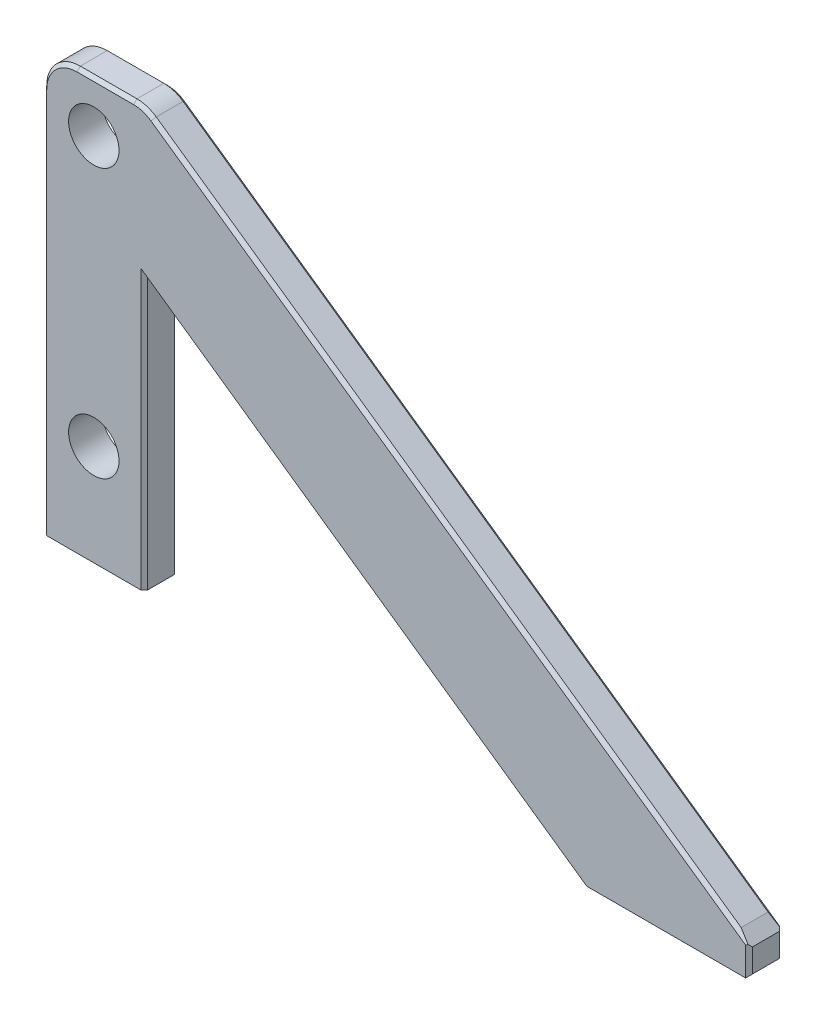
ISO-10303-21;
HEADER;
FILE_DESCRIPTION(('STEP AP214'),'2;1');
FILE_NAME('part.step','',(''),(''),'','','');
FILE_SCHEMA(('AUTOMOTIVE_DESIGN { 1 0 10303 214 1 1 1 1 }'));
ENDSEC;
DATA;
#1=APPLICATION_CONTEXT('core data for automotive mechanical design processes');
#2=APPLICATION_PROTOCOL_DEFINITION('international standard','automotive_design',2000,#1);
#3=PRODUCT_CONTEXT('',#1,'mechanical');
#4=PRODUCT('Part','Part','',(#3));
#5=PRODUCT_RELATED_PRODUCT_CATEGORY('part','',(#4));
#6=PRODUCT_DEFINITION_FORMATION('','',#4);
#7=PRODUCT_DEFINITION_CONTEXT('part definition',#1,'design');
#8=PRODUCT_DEFINITION('design','',#6,#7);
#9=PRODUCT_DEFINITION_SHAPE('','',#8);
#10=(LENGTH_UNIT() NAMED_UNIT(*) SI_UNIT(.MILLI.,.METRE.));
#11=(NAMED_UNIT(*) PLANE_ANGLE_UNIT() SI_UNIT($,.RADIAN.));
#12=(NAMED_UNIT(*) SI_UNIT($,.STERADIAN.) SOLID_ANGLE_UNIT());
#13=UNCERTAINTY_MEASURE_WITH_UNIT(LENGTH_MEASURE(1.E-05),#10,'distance_accuracy_value','');
#14=(GEOMETRIC_REPRESENTATION_CONTEXT(3) GLOBAL_UNCERTAINTY_ASSIGNED_CONTEXT((#13)) GLOBAL_UNIT_ASSIGNED_CONTEXT((#10,
#11,#12)) REPRESENTATION_CONTEXT('',''));
#15=CARTESIAN_POINT('',(0.,0.,0.));
#16=DIRECTION('',(0.,0.,1.));
#17=DIRECTION('',(1.,0.,0.));
#18=AXIS2_PLACEMENT_3D('',#15,#16,#17);
#19=CARTESIAN_POINT('',(-129.946648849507,90.9896230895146,10.));
#20=DIRECTION('',(0.,0.,-1.));
#21=DIRECTION('',(-1.,0.,0.));
#22=AXIS2_PLACEMENT_3D('',#19,#20,#21);
#23=PLANE('',#22);
#24=CARTESIAN_POINT('',(-144.946648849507,120.,10.));
#25=DIRECTION('',(0.,0.,1.));
#26=DIRECTION('',(1.,0.,0.));
#27=AXIS2_PLACEMENT_3D('',#24,#25,#26);
#28=CIRCLE('',#27,7.50000000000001);
#29=CARTESIAN_POINT('',(-137.446648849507,120.,10.));
#30=VERTEX_POINT('',#29);
#31=EDGE_CURVE('E222',#30,#30,#28,.T.);
#32=ORIENTED_EDGE('',*,*,#31,.F.);
#33=EDGE_LOOP('',(#32));
#34=FACE_BOUND('',#33,.T.);
#35=DIRECTION('',(1.,0.,0.));
#36=VECTOR('',#35,1.);
#37=CARTESIAN_POINT('',(50.,0.,10.));
#38=LINE('',#37,#36);
#39=CARTESIAN_POINT('',(1.74344679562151,0.,10.0000000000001));
#40=VERTEX_POINT('',#39);
#41=CARTESIAN_POINT('',(49.,0.,10.));
#42=VERTEX_POINT('',#41);
#43=EDGE_CURVE('E210',#40,#42,#38,.T.);
#44=ORIENTED_EDGE('',*,*,#43,.T.);
#45=DIRECTION('',(0.,1.,0.));
#46=VECTOR('',#45,1.);
#47=CARTESIAN_POINT('',(49.,90.9896230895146,10.));
#48=LINE('',#47,#46);
#49=CARTESIAN_POINT('',(49.,8.47943294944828,10.));
#50=VERTEX_POINT('',#49);
#51=EDGE_CURVE('E354',#42,#50,#48,.T.);
#52=ORIENTED_EDGE('',*,*,#51,.T.);
#53=DIRECTION('',(-0.819152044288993,0.573576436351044,0.));
#54=VECTOR('',#53,1.);
#55=CARTESIAN_POINT('',(-109.842112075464,119.701877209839,10.));
#56=LINE('',#55,#54);
#57=CARTESIAN_POINT('',(-127.937448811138,132.372368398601,10.));
#58=VERTEX_POINT('',#57);
#59=EDGE_CURVE('E245',#50,#58,#56,.T.);
#60=ORIENTED_EDGE('',*,*,#59,.T.);
#61=CARTESIAN_POINT('',(-133.099636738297,125.,10.));
#62=DIRECTION('',(0.,0.,-1.));
#63=DIRECTION('',(-1.,0.,0.));
#64=AXIS2_PLACEMENT_3D('',#61,#62,#63);
#65=CIRCLE('',#64,8.99999999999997);
#66=CARTESIAN_POINT('',(-133.099636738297,134.,10.));
#67=VERTEX_POINT('',#66);
#68=EDGE_CURVE('E247',#58,#67,#65,.F.);
#69=ORIENTED_EDGE('',*,*,#68,.T.);
#70=DIRECTION('',(-1.,0.,0.));
#71=VECTOR('',#70,1.);
#72=CARTESIAN_POINT('',(-129.946648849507,134.,10.));
#73=LINE('',#72,#71);
#74=CARTESIAN_POINT('',(-149.946648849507,134.,10.));
#75=VERTEX_POINT('',#74);
#76=EDGE_CURVE('E249',#67,#75,#73,.T.);
#77=ORIENTED_EDGE('',*,*,#76,.T.);
#78=CARTESIAN_POINT('',(-149.946648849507,125.,10.));
#79=DIRECTION('',(0.,0.,-1.));
#80=DIRECTION('',(-1.,0.,0.));
#81=AXIS2_PLACEMENT_3D('',#78,#79,#80);
#82=CIRCLE('',#81,8.99999999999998);
#83=CARTESIAN_POINT('',(-158.946648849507,125.,10.));
#84=VERTEX_POINT('',#83);
#85=EDGE_CURVE('E202',#75,#84,#82,.F.);
#86=ORIENTED_EDGE('',*,*,#85,.T.);
#87=DIRECTION('',(0.,-1.,0.));
#88=VECTOR('',#87,1.);
#89=CARTESIAN_POINT('',(-158.946648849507,90.9896230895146,10.));
#90=LINE('',#89,#88);
#91=CARTESIAN_POINT('',(-158.946648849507,9.99999999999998,10.));
#92=VERTEX_POINT('',#91);
#93=EDGE_CURVE('E186',#84,#92,#90,.T.);
#94=ORIENTED_EDGE('',*,*,#93,.T.);
#95=DIRECTION('',(1.,0.,0.));
#96=VECTOR('',#95,1.);
#97=CARTESIAN_POINT('',(-129.946648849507,9.99999999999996,10.));
#98=LINE('',#97,#96);
#99=CARTESIAN_POINT('',(-130.946648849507,9.99999999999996,10.));
#100=VERTEX_POINT('',#99);
#101=EDGE_CURVE('E199',#92,#100,#98,.T.);
#102=ORIENTED_EDGE('',*,*,#101,.T.);
#103=DIRECTION('',(0.,1.,0.));
#104=VECTOR('',#103,1.);
#105=CARTESIAN_POINT('',(-130.946648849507,90.9896230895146,10.));
#106=LINE('',#105,#104);
#107=CARTESIAN_POINT('',(-130.946648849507,92.9106052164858,10.));
#108=VERTEX_POINT('',#107);
#109=EDGE_CURVE('E243',#100,#108,#106,.T.);
#110=ORIENTED_EDGE('',*,*,#109,.T.);
#111=DIRECTION('',(0.819152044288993,-0.573576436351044,0.));
#112=VECTOR('',#111,1.);
#113=CARTESIAN_POINT('',(-129.373072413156,91.8087751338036,10.));
#114=LINE('',#113,#112);
#115=EDGE_CURVE('E241',#108,#40,#114,.T.);
#116=ORIENTED_EDGE('',*,*,#115,.T.);
#117=EDGE_LOOP('',(#44,#52,#60,#69,#77,#86,#94,#102,#110,#116));
#118=FACE_BOUND('',#117,.T.);
#119=CARTESIAN_POINT('',(-144.946648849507,39.9999999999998,10.));
#120=DIRECTION('',(0.,0.,1.));
#121=DIRECTION('',(1.,0.,0.));
#122=AXIS2_PLACEMENT_3D('',#119,#120,#121);
#123=CIRCLE('',#122,7.50000000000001);
#124=CARTESIAN_POINT('',(-137.446648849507,39.9999999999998,10.));
#125=VERTEX_POINT('',#124);
#126=EDGE_CURVE('E770',#125,#125,#123,.T.);
#127=ORIENTED_EDGE('',*,*,#126,.F.);
#128=EDGE_LOOP('',(#127));
#129=FACE_BOUND('',#128,.T.);
#130=ADVANCED_FACE('F32',(#34,#118,#129),#23,.F.);
#131=CARTESIAN_POINT('',(-129.946648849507,90.9896230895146,0.));
#132=DIRECTION('',(0.,0.,-1.));
#133=DIRECTION('',(-1.,0.,0.));
#134=AXIS2_PLACEMENT_3D('',#131,#132,#133);
#135=PLANE('',#134);
#136=CARTESIAN_POINT('',(-144.946648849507,120.,0.));
#137=DIRECTION('',(0.,0.,1.));
#138=DIRECTION('',(1.,0.,0.));
#139=AXIS2_PLACEMENT_3D('',#136,#137,#138);
#140=CIRCLE('',#139,7.50000000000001);
#141=CARTESIAN_POINT('',(-137.446648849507,120.,0.));
#142=VERTEX_POINT('',#141);
#143=EDGE_CURVE('E769',#142,#142,#140,.T.);
#144=ORIENTED_EDGE('',*,*,#143,.T.);
#145=EDGE_LOOP('',(#144));
#146=FACE_BOUND('',#145,.T.);
#147=DIRECTION('',(0.819152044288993,-0.573576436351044,0.));
#148=VECTOR('',#147,1.);
#149=CARTESIAN_POINT('',(49.426423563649,8.18084795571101,0.));
#150=LINE('',#149,#148);
#151=CARTESIAN_POINT('',(-127.937448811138,132.372368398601,0.));
#152=VERTEX_POINT('',#151);
#153=CARTESIAN_POINT('',(49.,8.47943294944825,0.));
#154=VERTEX_POINT('',#153);
#155=EDGE_CURVE('E290',#152,#154,#150,.T.);
#156=ORIENTED_EDGE('',*,*,#155,.T.);
#157=DIRECTION('',(0.,-1.,0.));
#158=VECTOR('',#157,1.);
#159=CARTESIAN_POINT('',(49.,0.,0.));
#160=LINE('',#159,#158);
#161=CARTESIAN_POINT('',(49.,0.,0.));
#162=VERTEX_POINT('',#161);
#163=EDGE_CURVE('E349',#154,#162,#160,.T.);
#164=ORIENTED_EDGE('',*,*,#163,.T.);
#165=DIRECTION('',(1.,0.,0.));
#166=VECTOR('',#165,1.);
#167=CARTESIAN_POINT('',(50.,0.,0.));
#168=LINE('',#167,#166);
#169=CARTESIAN_POINT('',(1.74344679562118,0.,0.));
#170=VERTEX_POINT('',#169);
#171=EDGE_CURVE('E219',#170,#162,#168,.T.);
#172=ORIENTED_EDGE('',*,*,#171,.F.);
#173=DIRECTION('',(-0.819152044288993,0.573576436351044,0.));
#174=VECTOR('',#173,1.);
#175=CARTESIAN_POINT('',(-129.373072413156,91.8087751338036,0.));
#176=LINE('',#175,#174);
#177=CARTESIAN_POINT('',(-130.946648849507,92.9106052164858,0.));
#178=VERTEX_POINT('',#177);
#179=EDGE_CURVE('E328',#170,#178,#176,.T.);
#180=ORIENTED_EDGE('',*,*,#179,.T.);
#181=DIRECTION('',(0.,-1.,0.));
#182=VECTOR('',#181,1.);
#183=CARTESIAN_POINT('',(-130.946648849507,9.99999999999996,0.));
#184=LINE('',#183,#182);
#185=CARTESIAN_POINT('',(-130.946648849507,9.99999999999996,0.));
#186=VERTEX_POINT('',#185);
#187=EDGE_CURVE('E326',#178,#186,#184,.T.);
#188=ORIENTED_EDGE('',*,*,#187,.T.);
#189=DIRECTION('',(1.,0.,0.));
#190=VECTOR('',#189,1.);
#191=CARTESIAN_POINT('',(-129.946648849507,9.99999999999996,0.));
#192=LINE('',#191,#190);
#193=CARTESIAN_POINT('',(-158.946648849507,9.99999999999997,0.));
#194=VERTEX_POINT('',#193);
#195=EDGE_CURVE('E215',#194,#186,#192,.T.);
#196=ORIENTED_EDGE('',*,*,#195,.F.);
#197=DIRECTION('',(0.,1.,0.));
#198=VECTOR('',#197,1.);
#199=CARTESIAN_POINT('',(-158.946648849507,125.,0.));
#200=LINE('',#199,#198);
#201=CARTESIAN_POINT('',(-158.946648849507,125.,0.));
#202=VERTEX_POINT('',#201);
#203=EDGE_CURVE('E299',#194,#202,#200,.T.);
#204=ORIENTED_EDGE('',*,*,#203,.T.);
#205=CARTESIAN_POINT('',(-149.946648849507,125.,0.));
#206=DIRECTION('',(0.,0.,-1.));
#207=DIRECTION('',(-1.,0.,0.));
#208=AXIS2_PLACEMENT_3D('',#205,#206,#207);
#209=CIRCLE('',#208,8.99999999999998);
#210=CARTESIAN_POINT('',(-149.946648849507,134.,0.));
#211=VERTEX_POINT('',#210);
#212=EDGE_CURVE('E297',#202,#211,#209,.T.);
#213=ORIENTED_EDGE('',*,*,#212,.T.);
#214=DIRECTION('',(1.,0.,0.));
#215=VECTOR('',#214,1.);
#216=CARTESIAN_POINT('',(-133.099636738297,134.,0.));
#217=LINE('',#216,#215);
#218=CARTESIAN_POINT('',(-133.099636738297,134.,0.));
#219=VERTEX_POINT('',#218);
#220=EDGE_CURVE('E295',#211,#219,#217,.T.);
#221=ORIENTED_EDGE('',*,*,#220,.T.);
#222=CARTESIAN_POINT('',(-133.099636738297,125.,0.));
#223=DIRECTION('',(0.,0.,-1.));
#224=DIRECTION('',(-1.,0.,0.));
#225=AXIS2_PLACEMENT_3D('',#222,#223,#224);
#226=CIRCLE('',#225,8.99999999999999);
#227=EDGE_CURVE('E293',#219,#152,#226,.T.);
#228=ORIENTED_EDGE('',*,*,#227,.T.);
#229=EDGE_LOOP('',(#156,#164,#172,#180,#188,#196,#204,#213,#221,#228));
#230=FACE_BOUND('',#229,.T.);
#231=CARTESIAN_POINT('',(-144.946648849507,39.9999999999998,0.));
#232=DIRECTION('',(0.,0.,1.));
#233=DIRECTION('',(1.,0.,0.));
#234=AXIS2_PLACEMENT_3D('',#231,#232,#233);
#235=CIRCLE('',#234,7.50000000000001);
#236=CARTESIAN_POINT('',(-137.446648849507,39.9999999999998,0.));
#237=VERTEX_POINT('',#236);
#238=EDGE_CURVE('E283',#237,#237,#235,.T.);
#239=ORIENTED_EDGE('',*,*,#238,.T.);
#240=EDGE_LOOP('',(#239));
#241=FACE_BOUND('',#240,.T.);
#242=ADVANCED_FACE('F410',(#146,#230,#241),#135,.T.);
#243=CARTESIAN_POINT('',(-129.946648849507,90.9896230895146,10.));
#244=DIRECTION('',(0.573576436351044,0.819152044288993,0.));
#245=DIRECTION('',(-0.819152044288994,0.573576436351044,0.));
#246=AXIS2_PLACEMENT_3D('',#243,#244,#245);
#247=PLANE('',#246);
#248=DIRECTION('',(0.,0.,-1.));
#249=VECTOR('',#248,1.);
#250=CARTESIAN_POINT('',(-129.946648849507,90.9896230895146,10.));
#251=LINE('',#250,#249);
#252=CARTESIAN_POINT('',(-129.946648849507,90.9896230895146,8.99999999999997));
#253=VERTEX_POINT('',#252);
#254=CARTESIAN_POINT('',(-129.946648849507,90.9896230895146,1.00000000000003));
#255=VERTEX_POINT('',#254);
#256=EDGE_CURVE('E209',#253,#255,#251,.T.);
#257=ORIENTED_EDGE('',*,*,#256,.T.);
#258=DIRECTION('',(0.819152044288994,-0.573576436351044,0.));
#259=VECTOR('',#258,1.);
#260=CARTESIAN_POINT('',(0.,0.,1.00000000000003));
#261=LINE('',#260,#259);
#262=CARTESIAN_POINT('',(0.,0.,1.00000000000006));
#263=VERTEX_POINT('',#262);
#264=EDGE_CURVE('E309',#255,#263,#261,.T.);
#265=ORIENTED_EDGE('',*,*,#264,.T.);
#266=DIRECTION('',(0.,0.,-1.));
#267=VECTOR('',#266,1.);
#268=CARTESIAN_POINT('',(0.,0.,10.));
#269=LINE('',#268,#267);
#270=CARTESIAN_POINT('',(0.,0.,8.99999999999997));
#271=VERTEX_POINT('',#270);
#272=EDGE_CURVE('E228',#271,#263,#269,.T.);
#273=ORIENTED_EDGE('',*,*,#272,.F.);
#274=DIRECTION('',(-0.819152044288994,0.573576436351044,0.));
#275=VECTOR('',#274,1.);
#276=CARTESIAN_POINT('',(-129.946648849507,90.9896230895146,8.99999999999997));
#277=LINE('',#276,#275);
#278=EDGE_CURVE('E268',#271,#253,#277,.T.);
#279=ORIENTED_EDGE('',*,*,#278,.T.);
#280=EDGE_LOOP('',(#257,#265,#273,#279));
#281=FACE_BOUND('',#280,.T.);
#282=ADVANCED_FACE('F424',(#281),#247,.F.);
#283=CARTESIAN_POINT('',(50.,0.,10.));
#284=DIRECTION('',(0.,1.,0.));
#285=DIRECTION('',(0.,0.,1.));
#286=AXIS2_PLACEMENT_3D('',#283,#284,#285);
#287=PLANE('',#286);
#288=ORIENTED_EDGE('',*,*,#171,.T.);
#289=DIRECTION('',(0.,0.,1.));
#290=VECTOR('',#289,1.);
#291=CARTESIAN_POINT('',(49.,0.,10.));
#292=LINE('',#291,#290);
#293=EDGE_CURVE('E352',#162,#42,#292,.T.);
#294=ORIENTED_EDGE('',*,*,#293,.T.);
#295=ORIENTED_EDGE('',*,*,#43,.F.);
#296=DIRECTION('',(0.867439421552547,0.,0.497542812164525));
#297=VECTOR('',#296,1.);
#298=CARTESIAN_POINT('',(-96.9153288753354,0.,-46.5883489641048));
#299=LINE('',#298,#297);
#300=EDGE_CURVE('E266',#40,#271,#299,.F.);
#301=ORIENTED_EDGE('',*,*,#300,.T.);
#302=ORIENTED_EDGE('',*,*,#272,.T.);
#303=DIRECTION('',(0.867439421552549,0.,-0.497542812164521));
#304=VECTOR('',#303,1.);
#305=CARTESIAN_POINT('',(-97.7785053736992,0.,57.0834466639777));
#306=LINE('',#305,#304);
#307=EDGE_CURVE('E324',#263,#170,#306,.T.);
#308=ORIENTED_EDGE('',*,*,#307,.T.);
#309=EDGE_LOOP('',(#288,#294,#295,#301,#302,#308));
#310=FACE_BOUND('',#309,.T.);
#311=ADVANCED_FACE('F428',(#310),#287,.F.);
#312=CARTESIAN_POINT('',(50.,9.,10.));
#313=DIRECTION('',(-1.,0.,0.));
#314=DIRECTION('',(0.,0.,1.));
#315=AXIS2_PLACEMENT_3D('',#312,#313,#314);
#316=PLANE('',#315);
#317=DIRECTION('',(0.,0.,-1.));
#318=VECTOR('',#317,1.);
#319=CARTESIAN_POINT('',(50.,1.,10.));
#320=LINE('',#319,#318);
#321=CARTESIAN_POINT('',(50.,1.,9.));
#322=VERTEX_POINT('',#321);
#323=CARTESIAN_POINT('',(50.,1.,1.));
#324=VERTEX_POINT('',#323);
#325=EDGE_CURVE('E340',#322,#324,#320,.T.);
#326=ORIENTED_EDGE('',*,*,#325,.T.);
#327=DIRECTION('',(0.,1.,0.));
#328=VECTOR('',#327,1.);
#329=CARTESIAN_POINT('',(50.,7.77922541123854,1.));
#330=LINE('',#329,#328);
#331=CARTESIAN_POINT('',(50.,8.00000000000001,1.));
#332=VERTEX_POINT('',#331);
#333=EDGE_CURVE('E342',#324,#332,#330,.T.);
#334=ORIENTED_EDGE('',*,*,#333,.T.);
#335=DIRECTION('',(0.,0.,1.));
#336=VECTOR('',#335,1.);
#337=CARTESIAN_POINT('',(50.,8.00000000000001,10.));
#338=LINE('',#337,#336);
#339=CARTESIAN_POINT('',(50.,8.00000000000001,9.));
#340=VERTEX_POINT('',#339);
#341=EDGE_CURVE('E334',#332,#340,#338,.T.);
#342=ORIENTED_EDGE('',*,*,#341,.T.);
#343=DIRECTION('',(0.,-1.,0.));
#344=VECTOR('',#343,1.);
#345=CARTESIAN_POINT('',(50.,9.,9.));
#346=LINE('',#345,#344);
#347=EDGE_CURVE('E338',#340,#322,#346,.T.);
#348=ORIENTED_EDGE('',*,*,#347,.T.);
#349=EDGE_LOOP('',(#326,#334,#342,#348));
#350=FACE_BOUND('',#349,.T.);
#351=ADVANCED_FACE('F477',(#350),#316,.F.);
#352=CARTESIAN_POINT('',(50.,9.,10.));
#353=DIRECTION('',(-0.573576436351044,-0.819152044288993,0.));
#354=DIRECTION('',(0.819152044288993,-0.573576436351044,0.));
#355=AXIS2_PLACEMENT_3D('',#352,#353,#354);
#356=PLANE('',#355);
#357=DIRECTION('',(0.819152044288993,-0.573576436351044,0.));
#358=VECTOR('',#357,1.);
#359=CARTESIAN_POINT('',(50.,9.,8.99999999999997));
#360=LINE('',#359,#358);
#361=CARTESIAN_POINT('',(-127.363872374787,133.19152044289,8.99999999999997));
#362=VERTEX_POINT('',#361);
#363=CARTESIAN_POINT('',(46.6643590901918,11.3356409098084,9.00000000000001));
#364=VERTEX_POINT('',#363);
#365=EDGE_CURVE('E262',#362,#364,#360,.T.);
#366=ORIENTED_EDGE('',*,*,#365,.T.);
#367=DIRECTION('',(0.,0.,-1.));
#368=VECTOR('',#367,1.);
#369=CARTESIAN_POINT('',(46.6643590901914,11.3356409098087,10.));
#370=LINE('',#369,#368);
#371=CARTESIAN_POINT('',(46.6643590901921,11.3356409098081,0.999999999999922));
#372=VERTEX_POINT('',#371);
#373=EDGE_CURVE('E11',#364,#372,#370,.T.);
#374=ORIENTED_EDGE('',*,*,#373,.T.);
#375=DIRECTION('',(-0.819152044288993,0.573576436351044,0.));
#376=VECTOR('',#375,1.);
#377=CARTESIAN_POINT('',(-127.363872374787,133.19152044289,0.999999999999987));
#378=LINE('',#377,#376);
#379=CARTESIAN_POINT('',(-127.363872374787,133.19152044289,0.999999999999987));
#380=VERTEX_POINT('',#379);
#381=EDGE_CURVE('E307',#372,#380,#378,.T.);
#382=ORIENTED_EDGE('',*,*,#381,.T.);
#383=DIRECTION('',(0.,0.,-1.));
#384=VECTOR('',#383,1.);
#385=CARTESIAN_POINT('',(-127.363872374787,133.19152044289,10.));
#386=LINE('',#385,#384);
#387=EDGE_CURVE('E239',#380,#362,#386,.F.);
#388=ORIENTED_EDGE('',*,*,#387,.T.);
#389=EDGE_LOOP('',(#366,#374,#382,#388));
#390=FACE_BOUND('',#389,.T.);
#391=ADVANCED_FACE('F473',(#390),#356,.F.);
#392=CARTESIAN_POINT('',(-159.946648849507,135.,10.));
#393=DIRECTION('',(0.,-1.,0.));
#394=DIRECTION('',(0.,0.,-1.));
#395=AXIS2_PLACEMENT_3D('',#392,#393,#394);
#396=PLANE('',#395);
#397=DIRECTION('',(0.,0.,-1.));
#398=VECTOR('',#397,1.);
#399=CARTESIAN_POINT('',(-133.099636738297,135.,10.));
#400=LINE('',#399,#398);
#401=CARTESIAN_POINT('',(-133.099636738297,135.,8.99999999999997));
#402=VERTEX_POINT('',#401);
#403=CARTESIAN_POINT('',(-133.099636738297,135.,1.));
#404=VERTEX_POINT('',#403);
#405=EDGE_CURVE('E236',#402,#404,#400,.T.);
#406=ORIENTED_EDGE('',*,*,#405,.T.);
#407=DIRECTION('',(-1.,0.,0.));
#408=VECTOR('',#407,1.);
#409=CARTESIAN_POINT('',(-149.946648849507,135.,1.));
#410=LINE('',#409,#408);
#411=CARTESIAN_POINT('',(-149.946648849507,135.,1.));
#412=VERTEX_POINT('',#411);
#413=EDGE_CURVE('E303',#404,#412,#410,.T.);
#414=ORIENTED_EDGE('',*,*,#413,.T.);
#415=DIRECTION('',(0.,0.,-1.));
#416=VECTOR('',#415,1.);
#417=CARTESIAN_POINT('',(-149.946648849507,135.,10.));
#418=LINE('',#417,#416);
#419=CARTESIAN_POINT('',(-149.946648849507,135.,8.99999999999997));
#420=VERTEX_POINT('',#419);
#421=EDGE_CURVE('E234',#412,#420,#418,.F.);
#422=ORIENTED_EDGE('',*,*,#421,.T.);
#423=DIRECTION('',(1.,0.,0.));
#424=VECTOR('',#423,1.);
#425=CARTESIAN_POINT('',(-159.946648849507,135.,8.99999999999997));
#426=LINE('',#425,#424);
#427=EDGE_CURVE('E257',#420,#402,#426,.T.);
#428=ORIENTED_EDGE('',*,*,#427,.T.);
#429=EDGE_LOOP('',(#406,#414,#422,#428));
#430=FACE_BOUND('',#429,.T.);
#431=ADVANCED_FACE('F470',(#430),#396,.F.);
#432=CARTESIAN_POINT('',(-159.946648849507,9.99999999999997,10.));
#433=DIRECTION('',(1.,0.,0.));
#434=DIRECTION('',(0.,0.,-1.));
#435=AXIS2_PLACEMENT_3D('',#432,#433,#434);
#436=PLANE('',#435);
#437=DIRECTION('',(0.,0.,-1.));
#438=VECTOR('',#437,1.);
#439=CARTESIAN_POINT('',(-159.946648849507,125.,10.));
#440=LINE('',#439,#438);
#441=CARTESIAN_POINT('',(-159.946648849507,125.,8.99999999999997));
#442=VERTEX_POINT('',#441);
#443=CARTESIAN_POINT('',(-159.946648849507,125.,1.));
#444=VERTEX_POINT('',#443);
#445=EDGE_CURVE('E231',#442,#444,#440,.T.);
#446=ORIENTED_EDGE('',*,*,#445,.T.);
#447=DIRECTION('',(0.,-1.,0.));
#448=VECTOR('',#447,1.);
#449=CARTESIAN_POINT('',(-159.946648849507,9.99999999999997,1.));
#450=LINE('',#449,#448);
#451=CARTESIAN_POINT('',(-159.946648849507,9.99999999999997,1.));
#452=VERTEX_POINT('',#451);
#453=EDGE_CURVE('E270',#444,#452,#450,.T.);
#454=ORIENTED_EDGE('',*,*,#453,.T.);
#455=DIRECTION('',(0.,0.,-1.));
#456=VECTOR('',#455,1.);
#457=CARTESIAN_POINT('',(-159.946648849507,9.99999999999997,10.));
#458=LINE('',#457,#456);
#459=CARTESIAN_POINT('',(-159.946648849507,9.99999999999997,8.99999999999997));
#460=VERTEX_POINT('',#459);
#461=EDGE_CURVE('E226',#460,#452,#458,.T.);
#462=ORIENTED_EDGE('',*,*,#461,.F.);
#463=DIRECTION('',(0.,1.,0.));
#464=VECTOR('',#463,1.);
#465=CARTESIAN_POINT('',(-159.946648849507,9.99999999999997,8.99999999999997));
#466=LINE('',#465,#464);
#467=EDGE_CURVE('E187',#460,#442,#466,.T.);
#468=ORIENTED_EDGE('',*,*,#467,.T.);
#469=EDGE_LOOP('',(#446,#454,#462,#468));
#470=FACE_BOUND('',#469,.T.);
#471=ADVANCED_FACE('F399',(#470),#436,.F.);
#472=CARTESIAN_POINT('',(-129.946648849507,9.99999999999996,10.));
#473=DIRECTION('',(0.,1.,0.));
#474=DIRECTION('',(-1.,0.,0.));
#475=AXIS2_PLACEMENT_3D('',#472,#473,#474);
#476=PLANE('',#475);
#477=ORIENTED_EDGE('',*,*,#195,.T.);
#478=DIRECTION('',(0.707106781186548,0.,0.707106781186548));
#479=VECTOR('',#478,1.);
#480=CARTESIAN_POINT('',(-129.946648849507,9.99999999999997,1.00000000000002));
#481=LINE('',#480,#479);
#482=CARTESIAN_POINT('',(-129.946648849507,9.99999999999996,1.00000000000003));
#483=VERTEX_POINT('',#482);
#484=EDGE_CURVE('E332',#186,#483,#481,.T.);
#485=ORIENTED_EDGE('',*,*,#484,.T.);
#486=DIRECTION('',(0.,0.,-1.));
#487=VECTOR('',#486,1.);
#488=CARTESIAN_POINT('',(-129.946648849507,9.99999999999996,10.));
#489=LINE('',#488,#487);
#490=CARTESIAN_POINT('',(-129.946648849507,9.99999999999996,8.99999999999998));
#491=VERTEX_POINT('',#490);
#492=EDGE_CURVE('E213',#491,#483,#489,.T.);
#493=ORIENTED_EDGE('',*,*,#492,.F.);
#494=DIRECTION('',(0.707106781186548,0.,-0.707106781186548));
#495=VECTOR('',#494,1.);
#496=CARTESIAN_POINT('',(-130.946648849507,9.99999999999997,10.));
#497=LINE('',#496,#495);
#498=EDGE_CURVE('E192',#491,#100,#497,.F.);
#499=ORIENTED_EDGE('',*,*,#498,.T.);
#500=ORIENTED_EDGE('',*,*,#101,.F.);
#501=DIRECTION('',(0.707106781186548,0.,0.707106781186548));
#502=VECTOR('',#501,1.);
#503=CARTESIAN_POINT('',(-158.946648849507,9.99999999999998,9.99999999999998));
#504=LINE('',#503,#502);
#505=EDGE_CURVE('E182',#92,#460,#504,.F.);
#506=ORIENTED_EDGE('',*,*,#505,.T.);
#507=ORIENTED_EDGE('',*,*,#461,.T.);
#508=DIRECTION('',(0.707106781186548,0.,-0.707106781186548));
#509=VECTOR('',#508,1.);
#510=CARTESIAN_POINT('',(-159.946648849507,9.99999999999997,1.));
#511=LINE('',#510,#509);
#512=EDGE_CURVE('E288',#452,#194,#511,.T.);
#513=ORIENTED_EDGE('',*,*,#512,.T.);
#514=EDGE_LOOP('',(#477,#485,#493,#499,#500,#506,#507,#513));
#515=FACE_BOUND('',#514,.T.);
#516=ADVANCED_FACE('F206',(#515),#476,.F.);
#517=CARTESIAN_POINT('',(-129.946648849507,90.9896230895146,10.));
#518=DIRECTION('',(-1.,0.,0.));
#519=DIRECTION('',(0.,-1.,0.));
#520=AXIS2_PLACEMENT_3D('',#517,#518,#519);
#521=PLANE('',#520);
#522=ORIENTED_EDGE('',*,*,#492,.T.);
#523=DIRECTION('',(0.,1.,0.));
#524=VECTOR('',#523,1.);
#525=CARTESIAN_POINT('',(-129.946648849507,90.9896230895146,1.00000000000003));
#526=LINE('',#525,#524);
#527=EDGE_CURVE('E330',#483,#255,#526,.T.);
#528=ORIENTED_EDGE('',*,*,#527,.T.);
#529=ORIENTED_EDGE('',*,*,#256,.F.);
#530=DIRECTION('',(0.,-1.,0.));
#531=VECTOR('',#530,1.);
#532=CARTESIAN_POINT('',(-129.946648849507,90.9896230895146,8.99999999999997));
#533=LINE('',#532,#531);
#534=EDGE_CURVE('E264',#253,#491,#533,.T.);
#535=ORIENTED_EDGE('',*,*,#534,.T.);
#536=EDGE_LOOP('',(#522,#528,#529,#535));
#537=FACE_BOUND('',#536,.T.);
#538=ADVANCED_FACE('F436',(#537),#521,.F.);
#539=CARTESIAN_POINT('',(-144.946648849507,120.,10.));
#540=DIRECTION('',(0.,0.,-1.));
#541=DIRECTION('',(-1.,0.,0.));
#542=AXIS2_PLACEMENT_3D('',#539,#540,#541);
#543=CYLINDRICAL_SURFACE('',#542,7.50000000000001);
#544=ORIENTED_EDGE('',*,*,#31,.T.);
#545=EDGE_LOOP('',(#544));
#546=FACE_BOUND('',#545,.T.);
#547=ORIENTED_EDGE('',*,*,#143,.F.);
#548=EDGE_LOOP('',(#547));
#549=FACE_BOUND('',#548,.T.);
#550=ADVANCED_FACE('F461',(#546,#549),#543,.F.);
#551=CARTESIAN_POINT('',(-144.946648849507,39.9999999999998,10.));
#552=DIRECTION('',(0.,0.,-1.));
#553=DIRECTION('',(-1.,0.,0.));
#554=AXIS2_PLACEMENT_3D('',#551,#552,#553);
#555=CYLINDRICAL_SURFACE('',#554,7.50000000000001);
#556=ORIENTED_EDGE('',*,*,#126,.T.);
#557=EDGE_LOOP('',(#556));
#558=FACE_BOUND('',#557,.T.);
#559=ORIENTED_EDGE('',*,*,#238,.F.);
#560=EDGE_LOOP('',(#559));
#561=FACE_BOUND('',#560,.T.);
#562=ADVANCED_FACE('F489',(#558,#561),#555,.F.);
#563=CARTESIAN_POINT('',(-149.946648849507,125.,10.));
#564=DIRECTION('',(0.,0.,-1.));
#565=DIRECTION('',(-1.,0.,0.));
#566=AXIS2_PLACEMENT_3D('',#563,#564,#565);
#567=CYLINDRICAL_SURFACE('',#566,10.);
#568=ORIENTED_EDGE('',*,*,#421,.F.);
#569=CARTESIAN_POINT('',(-149.946648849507,125.,1.));
#570=DIRECTION('',(0.,0.,-1.));
#571=DIRECTION('',(-1.,0.,0.));
#572=AXIS2_PLACEMENT_3D('',#569,#570,#571);
#573=CIRCLE('',#572,10.);
#574=EDGE_CURVE('E301',#412,#444,#573,.F.);
#575=ORIENTED_EDGE('',*,*,#574,.T.);
#576=ORIENTED_EDGE('',*,*,#445,.F.);
#577=CARTESIAN_POINT('',(-149.946648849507,125.,8.99999999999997));
#578=DIRECTION('',(0.,0.,-1.));
#579=DIRECTION('',(-1.,0.,0.));
#580=AXIS2_PLACEMENT_3D('',#577,#578,#579);
#581=CIRCLE('',#580,10.);
#582=EDGE_CURVE('E254',#442,#420,#581,.T.);
#583=ORIENTED_EDGE('',*,*,#582,.T.);
#584=EDGE_LOOP('',(#568,#575,#576,#583));
#585=FACE_BOUND('',#584,.T.);
#586=ADVANCED_FACE('F394',(#585),#567,.T.);
#587=CARTESIAN_POINT('',(-133.099636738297,125.,10.));
#588=DIRECTION('',(0.,0.,-1.));
#589=DIRECTION('',(-1.,0.,0.));
#590=AXIS2_PLACEMENT_3D('',#587,#588,#589);
#591=CYLINDRICAL_SURFACE('',#590,10.);
#592=ORIENTED_EDGE('',*,*,#387,.F.);
#593=CARTESIAN_POINT('',(-133.099636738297,125.,1.));
#594=DIRECTION('',(0.,0.,-1.));
#595=DIRECTION('',(-1.,0.,0.));
#596=AXIS2_PLACEMENT_3D('',#593,#594,#595);
#597=CIRCLE('',#596,10.);
#598=EDGE_CURVE('E305',#380,#404,#597,.F.);
#599=ORIENTED_EDGE('',*,*,#598,.T.);
#600=ORIENTED_EDGE('',*,*,#405,.F.);
#601=CARTESIAN_POINT('',(-133.099636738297,125.,8.99999999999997));
#602=DIRECTION('',(0.,0.,-1.));
#603=DIRECTION('',(-1.,0.,0.));
#604=AXIS2_PLACEMENT_3D('',#601,#602,#603);
#605=CIRCLE('',#604,10.);
#606=EDGE_CURVE('E259',#402,#362,#605,.T.);
#607=ORIENTED_EDGE('',*,*,#606,.T.);
#608=EDGE_LOOP('',(#592,#599,#600,#607));
#609=FACE_BOUND('',#608,.T.);
#610=ADVANCED_FACE('F488',(#609),#591,.T.);
#611=CARTESIAN_POINT('',(-109.842112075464,119.701877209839,10.));
#612=DIRECTION('',(-0.405579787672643,-0.579227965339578,-0.707106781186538));
#613=DIRECTION('',(0.,0.773589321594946,-0.633687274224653));
#614=AXIS2_PLACEMENT_3D('',#611,#612,#613);
#615=PLANE('',#614);
#616=ORIENTED_EDGE('',*,*,#59,.F.);
#617=DIRECTION('',(0.663578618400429,0.345437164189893,-0.663578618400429));
#618=VECTOR('',#617,1.);
#619=CARTESIAN_POINT('',(4.55094038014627,-14.6592829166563,54.4490596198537));
#620=LINE('',#619,#618);
#621=CARTESIAN_POINT('',(49.3423506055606,8.65764939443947,9.65764939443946));
#622=VERTEX_POINT('',#621);
#623=EDGE_CURVE('E41',#50,#622,#620,.T.);
#624=ORIENTED_EDGE('',*,*,#623,.T.);
#625=DIRECTION('',(-0.696681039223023,0.696681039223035,-0.171087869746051));
#626=VECTOR('',#625,1.);
#627=CARTESIAN_POINT('',(-81.7762486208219,139.776248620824,-22.5418803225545));
#628=LINE('',#627,#626);
#629=EDGE_CURVE('E53',#622,#364,#628,.T.);
#630=ORIENTED_EDGE('',*,*,#629,.T.);
#631=ORIENTED_EDGE('',*,*,#365,.F.);
#632=DIRECTION('',(0.405579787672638,0.579227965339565,-0.707106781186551));
#633=VECTOR('',#632,1.);
#634=CARTESIAN_POINT('',(-127.937448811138,132.372368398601,10.));
#635=LINE('',#634,#633);
#636=EDGE_CURVE('E280',#58,#362,#635,.T.);
#637=ORIENTED_EDGE('',*,*,#636,.F.);
#638=EDGE_LOOP('',(#616,#624,#630,#631,#637));
#639=FACE_BOUND('',#638,.T.);
#640=ADVANCED_FACE('F377',(#639),#615,.F.);
#641=CARTESIAN_POINT('',(-133.099636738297,125.,10.));
#642=DIRECTION('',(0.,0.,-1.));
#643=DIRECTION('',(-1.,0.,0.));
#644=AXIS2_PLACEMENT_3D('',#641,#642,#643);
#645=CONICAL_SURFACE('',#644,8.99999999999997,0.785398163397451);
#646=ORIENTED_EDGE('',*,*,#636,.T.);
#647=ORIENTED_EDGE('',*,*,#606,.F.);
#648=DIRECTION('',(0.,0.707106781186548,-0.707106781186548));
#649=VECTOR('',#648,1.);
#650=CARTESIAN_POINT('',(-133.099636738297,134.,10.));
#651=LINE('',#650,#649);
#652=EDGE_CURVE('E277',#67,#402,#651,.T.);
#653=ORIENTED_EDGE('',*,*,#652,.F.);
#654=ORIENTED_EDGE('',*,*,#68,.F.);
#655=EDGE_LOOP('',(#646,#647,#653,#654));
#656=FACE_BOUND('',#655,.T.);
#657=ADVANCED_FACE('F382',(#656),#645,.T.);
#658=CARTESIAN_POINT('',(-129.946648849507,134.,10.));
#659=DIRECTION('',(0.,-0.707106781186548,-0.707106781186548));
#660=DIRECTION('',(0.,0.707106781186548,-0.707106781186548));
#661=AXIS2_PLACEMENT_3D('',#658,#659,#660);
#662=PLANE('',#661);
#663=ORIENTED_EDGE('',*,*,#652,.T.);
#664=ORIENTED_EDGE('',*,*,#427,.F.);
#665=DIRECTION('',(0.,0.707106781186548,-0.707106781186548));
#666=VECTOR('',#665,1.);
#667=CARTESIAN_POINT('',(-149.946648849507,134.,10.));
#668=LINE('',#667,#666);
#669=EDGE_CURVE('E273',#75,#420,#668,.T.);
#670=ORIENTED_EDGE('',*,*,#669,.F.);
#671=ORIENTED_EDGE('',*,*,#76,.F.);
#672=EDGE_LOOP('',(#663,#664,#670,#671));
#673=FACE_BOUND('',#672,.T.);
#674=ADVANCED_FACE('F387',(#673),#662,.F.);
#675=CARTESIAN_POINT('',(-149.946648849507,125.,10.));
#676=DIRECTION('',(0.,0.,-1.));
#677=DIRECTION('',(-1.,0.,0.));
#678=AXIS2_PLACEMENT_3D('',#675,#676,#677);
#679=CONICAL_SURFACE('',#678,8.99999999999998,0.785398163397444);
#680=ORIENTED_EDGE('',*,*,#669,.T.);
#681=ORIENTED_EDGE('',*,*,#582,.F.);
#682=DIRECTION('',(-0.707106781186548,0.,-0.707106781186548));
#683=VECTOR('',#682,1.);
#684=CARTESIAN_POINT('',(-158.946648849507,125.,10.));
#685=LINE('',#684,#683);
#686=EDGE_CURVE('E271',#84,#442,#685,.T.);
#687=ORIENTED_EDGE('',*,*,#686,.F.);
#688=ORIENTED_EDGE('',*,*,#85,.F.);
#689=EDGE_LOOP('',(#680,#681,#687,#688));
#690=FACE_BOUND('',#689,.T.);
#691=ADVANCED_FACE('F390',(#690),#679,.T.);
#692=CARTESIAN_POINT('',(-158.946648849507,90.9896230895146,10.));
#693=DIRECTION('',(0.707106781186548,0.,-0.707106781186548));
#694=DIRECTION('',(-0.707106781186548,0.,-0.707106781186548));
#695=AXIS2_PLACEMENT_3D('',#692,#693,#694);
#696=PLANE('',#695);
#697=ORIENTED_EDGE('',*,*,#686,.T.);
#698=ORIENTED_EDGE('',*,*,#467,.F.);
#699=ORIENTED_EDGE('',*,*,#505,.F.);
#700=ORIENTED_EDGE('',*,*,#93,.F.);
#701=EDGE_LOOP('',(#697,#698,#699,#700));
#702=FACE_BOUND('',#701,.T.);
#703=ADVANCED_FACE('F185',(#702),#696,.F.);
#704=CARTESIAN_POINT('',(-129.373072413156,91.8087751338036,10.));
#705=DIRECTION('',(0.405579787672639,0.579227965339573,-0.707106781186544));
#706=DIRECTION('',(0.,0.773589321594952,0.633687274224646));
#707=AXIS2_PLACEMENT_3D('',#704,#705,#706);
#708=PLANE('',#707);
#709=ORIENTED_EDGE('',*,*,#300,.F.);
#710=ORIENTED_EDGE('',*,*,#115,.F.);
#711=DIRECTION('',(0.41921545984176,-0.805305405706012,-0.41921545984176));
#712=VECTOR('',#711,1.);
#713=CARTESIAN_POINT('',(-130.298132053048,91.6648160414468,9.35148320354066));
#714=LINE('',#713,#712);
#715=EDGE_CURVE('E274',#253,#108,#714,.F.);
#716=ORIENTED_EDGE('',*,*,#715,.F.);
#717=ORIENTED_EDGE('',*,*,#278,.F.);
#718=EDGE_LOOP('',(#709,#710,#716,#717));
#719=FACE_BOUND('',#718,.T.);
#720=ADVANCED_FACE('F432',(#719),#708,.F.);
#721=CARTESIAN_POINT('',(-130.946648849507,90.9896230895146,10.));
#722=DIRECTION('',(-0.707106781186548,0.,-0.707106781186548));
#723=DIRECTION('',(-0.707106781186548,0.,0.707106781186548));
#724=AXIS2_PLACEMENT_3D('',#721,#722,#723);
#725=PLANE('',#724);
#726=ORIENTED_EDGE('',*,*,#498,.F.);
#727=ORIENTED_EDGE('',*,*,#534,.F.);
#728=ORIENTED_EDGE('',*,*,#715,.T.);
#729=ORIENTED_EDGE('',*,*,#109,.F.);
#730=EDGE_LOOP('',(#726,#727,#728,#729));
#731=FACE_BOUND('',#730,.T.);
#732=ADVANCED_FACE('F438',(#731),#725,.F.);
#733=CARTESIAN_POINT('',(50.,9.,1.));
#734=DIRECTION('',(0.405579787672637,0.57922796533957,-0.707106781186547));
#735=DIRECTION('',(0.,0.773589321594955,0.633687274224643));
#736=AXIS2_PLACEMENT_3D('',#733,#734,#735);
#737=PLANE('',#736);
#738=DIRECTION('',(-0.696681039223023,0.696681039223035,0.171087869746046));
#739=VECTOR('',#738,1.);
#740=CARTESIAN_POINT('',(49.4169977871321,8.58300221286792,0.324019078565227));
#741=LINE('',#740,#739);
#742=CARTESIAN_POINT('',(49.3423506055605,8.6576493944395,0.342350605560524));
#743=VERTEX_POINT('',#742);
#744=EDGE_CURVE('E345',#372,#743,#741,.F.);
#745=ORIENTED_EDGE('',*,*,#744,.T.);
#746=DIRECTION('',(-0.663578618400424,-0.345437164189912,-0.663578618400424));
#747=VECTOR('',#746,1.);
#748=CARTESIAN_POINT('',(50.,9.,1.));
#749=LINE('',#748,#747);
#750=EDGE_CURVE('E347',#743,#154,#749,.T.);
#751=ORIENTED_EDGE('',*,*,#750,.T.);
#752=ORIENTED_EDGE('',*,*,#155,.F.);
#753=DIRECTION('',(-0.405579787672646,-0.579227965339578,-0.707106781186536));
#754=VECTOR('',#753,1.);
#755=CARTESIAN_POINT('',(-127.363872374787,133.19152044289,0.999999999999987));
#756=LINE('',#755,#754);
#757=EDGE_CURVE('E285',#380,#152,#756,.T.);
#758=ORIENTED_EDGE('',*,*,#757,.F.);
#759=ORIENTED_EDGE('',*,*,#381,.F.);
#760=EDGE_LOOP('',(#745,#751,#752,#758,#759));
#761=FACE_BOUND('',#760,.T.);
#762=ADVANCED_FACE('F440',(#761),#737,.T.);
#763=CARTESIAN_POINT('',(-133.099636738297,125.,0.));
#764=DIRECTION('',(0.,0.,1.));
#765=DIRECTION('',(1.,0.,0.));
#766=AXIS2_PLACEMENT_3D('',#763,#764,#765);
#767=CONICAL_SURFACE('',#766,8.99999999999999,0.785398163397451);
#768=ORIENTED_EDGE('',*,*,#757,.T.);
#769=ORIENTED_EDGE('',*,*,#227,.F.);
#770=DIRECTION('',(0.,-0.707106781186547,-0.707106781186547));
#771=VECTOR('',#770,1.);
#772=CARTESIAN_POINT('',(-133.099636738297,135.,1.));
#773=LINE('',#772,#771);
#774=EDGE_CURVE('E317',#404,#219,#773,.T.);
#775=ORIENTED_EDGE('',*,*,#774,.F.);
#776=ORIENTED_EDGE('',*,*,#598,.F.);
#777=EDGE_LOOP('',(#768,#769,#775,#776));
#778=FACE_BOUND('',#777,.T.);
#779=ADVANCED_FACE('F446',(#778),#767,.T.);
#780=CARTESIAN_POINT('',(-159.946648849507,135.,1.));
#781=DIRECTION('',(0.,0.707106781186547,-0.707106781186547));
#782=DIRECTION('',(0.,0.707106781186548,0.707106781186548));
#783=AXIS2_PLACEMENT_3D('',#780,#781,#782);
#784=PLANE('',#783);
#785=ORIENTED_EDGE('',*,*,#774,.T.);
#786=ORIENTED_EDGE('',*,*,#220,.F.);
#787=DIRECTION('',(0.,-0.707106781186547,-0.707106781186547));
#788=VECTOR('',#787,1.);
#789=CARTESIAN_POINT('',(-149.946648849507,135.,1.));
#790=LINE('',#789,#788);
#791=EDGE_CURVE('E313',#412,#211,#790,.T.);
#792=ORIENTED_EDGE('',*,*,#791,.F.);
#793=ORIENTED_EDGE('',*,*,#413,.F.);
#794=EDGE_LOOP('',(#785,#786,#792,#793));
#795=FACE_BOUND('',#794,.T.);
#796=ADVANCED_FACE('F569',(#795),#784,.T.);
#797=CARTESIAN_POINT('',(-149.946648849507,125.,0.));
#798=DIRECTION('',(0.,0.,1.));
#799=DIRECTION('',(1.,0.,0.));
#800=AXIS2_PLACEMENT_3D('',#797,#798,#799);
#801=CONICAL_SURFACE('',#800,8.99999999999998,0.785398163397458);
#802=ORIENTED_EDGE('',*,*,#791,.T.);
#803=ORIENTED_EDGE('',*,*,#212,.F.);
#804=DIRECTION('',(0.707106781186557,0.,-0.707106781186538));
#805=VECTOR('',#804,1.);
#806=CARTESIAN_POINT('',(-159.946648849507,125.,1.));
#807=LINE('',#806,#805);
#808=EDGE_CURVE('E310',#444,#202,#807,.T.);
#809=ORIENTED_EDGE('',*,*,#808,.F.);
#810=ORIENTED_EDGE('',*,*,#574,.F.);
#811=EDGE_LOOP('',(#802,#803,#809,#810));
#812=FACE_BOUND('',#811,.T.);
#813=ADVANCED_FACE('F403',(#812),#801,.T.);
#814=CARTESIAN_POINT('',(-159.946648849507,9.99999999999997,1.));
#815=DIRECTION('',(-0.707106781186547,0.,-0.707106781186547));
#816=DIRECTION('',(-0.707106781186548,0.,0.707106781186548));
#817=AXIS2_PLACEMENT_3D('',#814,#815,#816);
#818=PLANE('',#817);
#819=ORIENTED_EDGE('',*,*,#808,.T.);
#820=ORIENTED_EDGE('',*,*,#203,.F.);
#821=ORIENTED_EDGE('',*,*,#512,.F.);
#822=ORIENTED_EDGE('',*,*,#453,.F.);
#823=EDGE_LOOP('',(#819,#820,#821,#822));
#824=FACE_BOUND('',#823,.T.);
#825=ADVANCED_FACE('F406',(#824),#818,.T.);
#826=CARTESIAN_POINT('',(-129.946648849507,90.9896230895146,1.00000000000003));
#827=DIRECTION('',(0.707106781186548,0.,-0.707106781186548));
#828=DIRECTION('',(-0.707106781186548,0.,-0.707106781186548));
#829=AXIS2_PLACEMENT_3D('',#826,#827,#828);
#830=PLANE('',#829);
#831=ORIENTED_EDGE('',*,*,#484,.F.);
#832=ORIENTED_EDGE('',*,*,#187,.F.);
#833=DIRECTION('',(0.419215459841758,-0.805305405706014,0.419215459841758));
#834=VECTOR('',#833,1.);
#835=CARTESIAN_POINT('',(-129.946648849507,90.9896230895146,1.00000000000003));
#836=LINE('',#835,#834);
#837=EDGE_CURVE('E314',#255,#178,#836,.F.);
#838=ORIENTED_EDGE('',*,*,#837,.F.);
#839=ORIENTED_EDGE('',*,*,#527,.F.);
#840=EDGE_LOOP('',(#831,#832,#838,#839));
#841=FACE_BOUND('',#840,.T.);
#842=ADVANCED_FACE('F417',(#841),#830,.T.);
#843=CARTESIAN_POINT('',(-129.946648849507,90.9896230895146,1.00000000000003));
#844=DIRECTION('',(-0.405579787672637,-0.57922796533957,-0.707106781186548));
#845=DIRECTION('',(0.,0.773589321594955,-0.633687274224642));
#846=AXIS2_PLACEMENT_3D('',#843,#844,#845);
#847=PLANE('',#846);
#848=ORIENTED_EDGE('',*,*,#837,.T.);
#849=ORIENTED_EDGE('',*,*,#179,.F.);
#850=ORIENTED_EDGE('',*,*,#307,.F.);
#851=ORIENTED_EDGE('',*,*,#264,.F.);
#852=EDGE_LOOP('',(#848,#849,#850,#851));
#853=FACE_BOUND('',#852,.T.);
#854=ADVANCED_FACE('F421',(#853),#847,.T.);
#855=CARTESIAN_POINT('',(49.,90.9896230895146,10.));
#856=DIRECTION('',(-0.707106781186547,0.,-0.707106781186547));
#857=DIRECTION('',(-0.707106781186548,0.,0.707106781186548));
#858=AXIS2_PLACEMENT_3D('',#855,#856,#857);
#859=PLANE('',#858);
#860=ORIENTED_EDGE('',*,*,#623,.F.);
#861=ORIENTED_EDGE('',*,*,#51,.F.);
#862=DIRECTION('',(0.577350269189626,0.577350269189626,-0.577350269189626));
#863=VECTOR('',#862,1.);
#864=CARTESIAN_POINT('',(79.3298743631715,30.3298743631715,-20.3298743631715));
#865=LINE('',#864,#863);
#866=EDGE_CURVE('E36',#322,#42,#865,.F.);
#867=ORIENTED_EDGE('',*,*,#866,.F.);
#868=ORIENTED_EDGE('',*,*,#347,.F.);
#869=DIRECTION('',(-0.577350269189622,0.577350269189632,0.577350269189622));
#870=VECTOR('',#869,1.);
#871=CARTESIAN_POINT('',(21.6701256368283,36.3298743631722,37.3298743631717));
#872=LINE('',#871,#870);
#873=EDGE_CURVE('E361',#622,#340,#872,.F.);
#874=ORIENTED_EDGE('',*,*,#873,.F.);
#875=EDGE_LOOP('',(#860,#861,#867,#868,#874));
#876=FACE_BOUND('',#875,.T.);
#877=ADVANCED_FACE('F34',(#876),#859,.F.);
#878=CARTESIAN_POINT('',(50.,1.,10.));
#879=DIRECTION('',(-0.707106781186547,0.707106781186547,0.));
#880=DIRECTION('',(-0.707106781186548,-0.707106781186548,0.));
#881=AXIS2_PLACEMENT_3D('',#878,#879,#880);
#882=PLANE('',#881);
#883=ORIENTED_EDGE('',*,*,#866,.T.);
#884=ORIENTED_EDGE('',*,*,#293,.F.);
#885=DIRECTION('',(-0.577350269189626,-0.577350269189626,-0.577350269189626));
#886=VECTOR('',#885,1.);
#887=CARTESIAN_POINT('',(53.,4.,4.));
#888=LINE('',#887,#886);
#889=EDGE_CURVE('E360',#324,#162,#888,.T.);
#890=ORIENTED_EDGE('',*,*,#889,.F.);
#891=ORIENTED_EDGE('',*,*,#325,.F.);
#892=EDGE_LOOP('',(#883,#884,#890,#891));
#893=FACE_BOUND('',#892,.T.);
#894=ADVANCED_FACE('F370',(#893),#882,.F.);
#895=CARTESIAN_POINT('',(46.6643590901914,11.3356409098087,10.));
#896=DIRECTION('',(-0.707106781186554,-0.707106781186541,0.));
#897=DIRECTION('',(0.707106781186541,-0.707106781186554,0.));
#898=AXIS2_PLACEMENT_3D('',#895,#896,#897);
#899=PLANE('',#898);
#900=ORIENTED_EDGE('',*,*,#873,.T.);
#901=ORIENTED_EDGE('',*,*,#341,.F.);
#902=DIRECTION('',(0.577350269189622,-0.577350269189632,0.577350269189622));
#903=VECTOR('',#902,1.);
#904=CARTESIAN_POINT('',(50.7762393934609,7.2237606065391,1.77623939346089));
#905=LINE('',#904,#903);
#906=EDGE_CURVE('E358',#743,#332,#905,.T.);
#907=ORIENTED_EDGE('',*,*,#906,.F.);
#908=ORIENTED_EDGE('',*,*,#744,.F.);
#909=ORIENTED_EDGE('',*,*,#373,.F.);
#910=ORIENTED_EDGE('',*,*,#629,.F.);
#911=EDGE_LOOP('',(#900,#901,#907,#908,#909,#910));
#912=FACE_BOUND('',#911,.T.);
#913=ADVANCED_FACE('F620',(#912),#899,.F.);
#914=CARTESIAN_POINT('',(50.,9.,1.));
#915=DIRECTION('',(0.707106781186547,0.,-0.707106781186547));
#916=DIRECTION('',(-0.707106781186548,0.,-0.707106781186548));
#917=AXIS2_PLACEMENT_3D('',#914,#915,#916);
#918=PLANE('',#917);
#919=ORIENTED_EDGE('',*,*,#889,.T.);
#920=ORIENTED_EDGE('',*,*,#163,.F.);
#921=ORIENTED_EDGE('',*,*,#750,.F.);
#922=ORIENTED_EDGE('',*,*,#906,.T.);
#923=ORIENTED_EDGE('',*,*,#333,.F.);
#924=EDGE_LOOP('',(#919,#920,#921,#922,#923));
#925=FACE_BOUND('',#924,.T.);
#926=ADVANCED_FACE('F626',(#925),#918,.T.);
#927=CLOSED_SHELL('',(#130,#242,#282,#311,#351,#391,#431,#471,#516,#538,#550,#562,#586,#610,
#640,#657,#674,#691,#703,#720,#732,#762,#779,#796,#813,#825,#842,#854,#877,#894,#913,#926));
#928=MANIFOLD_SOLID_BREP('B2',#927);
#929=ADVANCED_BREP_SHAPE_REPRESENTATION('',(#18,#928),#14);
#930=SHAPE_DEFINITION_REPRESENTATION(#9,#929);
ENDSEC;
END-ISO-10303-21;
